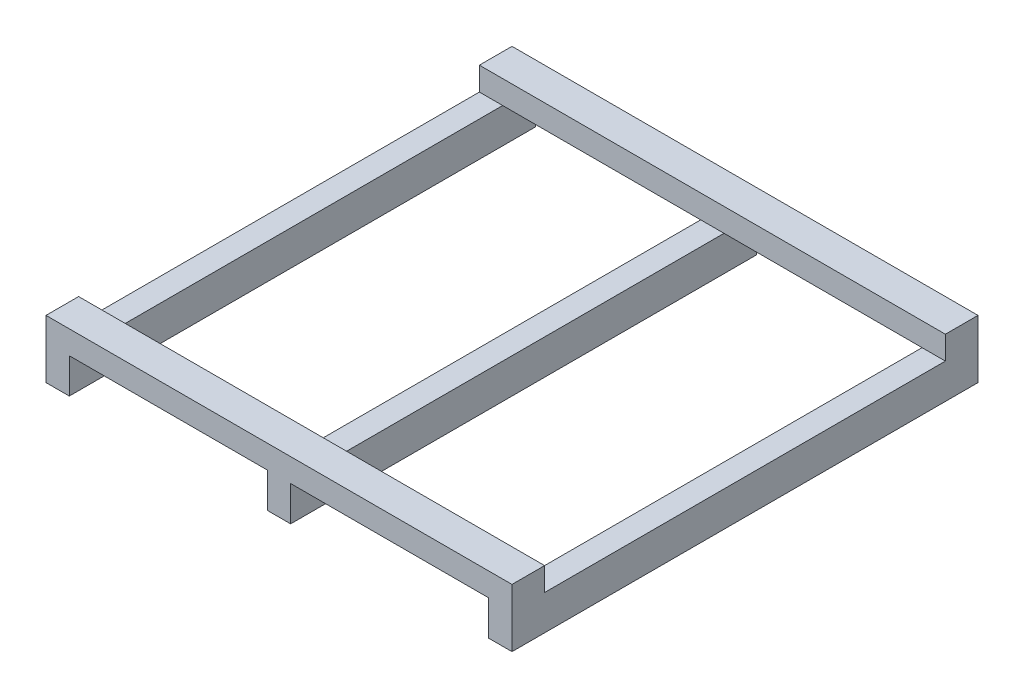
ISO-10303-21;
HEADER;
FILE_DESCRIPTION(('STEP AP214'),'2;1');
FILE_NAME('part.step','',(''),(''),'','','');
FILE_SCHEMA(('AUTOMOTIVE_DESIGN { 1 0 10303 214 1 1 1 1 }'));
ENDSEC;
DATA;
#1=APPLICATION_CONTEXT('core data for automotive mechanical design processes');
#2=APPLICATION_PROTOCOL_DEFINITION('international standard','automotive_design',2000,#1);
#3=PRODUCT_CONTEXT('',#1,'mechanical');
#4=PRODUCT('Part','Part','',(#3));
#5=PRODUCT_RELATED_PRODUCT_CATEGORY('part','',(#4));
#6=PRODUCT_DEFINITION_FORMATION('','',#4);
#7=PRODUCT_DEFINITION_CONTEXT('part definition',#1,'design');
#8=PRODUCT_DEFINITION('design','',#6,#7);
#9=PRODUCT_DEFINITION_SHAPE('','',#8);
#10=(LENGTH_UNIT() NAMED_UNIT(*) SI_UNIT(.MILLI.,.METRE.));
#11=(NAMED_UNIT(*) PLANE_ANGLE_UNIT() SI_UNIT($,.RADIAN.));
#12=(NAMED_UNIT(*) SI_UNIT($,.STERADIAN.) SOLID_ANGLE_UNIT());
#13=UNCERTAINTY_MEASURE_WITH_UNIT(LENGTH_MEASURE(1.E-05),#10,'distance_accuracy_value','');
#14=(GEOMETRIC_REPRESENTATION_CONTEXT(3) GLOBAL_UNCERTAINTY_ASSIGNED_CONTEXT((#13)) GLOBAL_UNIT_ASSIGNED_CONTEXT((#10,
#11,#12)) REPRESENTATION_CONTEXT('',''));
#15=CARTESIAN_POINT('',(0.,0.,0.));
#16=DIRECTION('',(0.,0.,1.));
#17=DIRECTION('',(1.,0.,0.));
#18=AXIS2_PLACEMENT_3D('',#15,#16,#17);
#19=CARTESIAN_POINT('',(586.023252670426,75.,-500.));
#20=DIRECTION('',(0.,-1.,0.));
#21=DIRECTION('',(0.,0.,-1.));
#22=AXIS2_PLACEMENT_3D('',#19,#20,#21);
#23=PLANE('',#22);
#24=DIRECTION('',(0.,0.,1.));
#25=VECTOR('',#24,1.);
#26=CARTESIAN_POINT('',(-25.,75.,-500.));
#27=LINE('',#26,#25);
#28=CARTESIAN_POINT('',(-25.,75.,-500.));
#29=VERTEX_POINT('',#28);
#30=CARTESIAN_POINT('',(-25.,75.,-430.));
#31=VERTEX_POINT('',#30);
#32=EDGE_CURVE('E261',#29,#31,#27,.T.);
#33=ORIENTED_EDGE('',*,*,#32,.T.);
#34=DIRECTION('',(-1.,0.,0.));
#35=VECTOR('',#34,1.);
#36=CARTESIAN_POINT('',(586.023252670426,75.,-430.));
#37=LINE('',#36,#35);
#38=CARTESIAN_POINT('',(-450.,75.,-430.));
#39=VERTEX_POINT('',#38);
#40=EDGE_CURVE('E275',#31,#39,#37,.T.);
#41=ORIENTED_EDGE('',*,*,#40,.T.);
#42=DIRECTION('',(0.,0.,1.));
#43=VECTOR('',#42,1.);
#44=CARTESIAN_POINT('',(-450.,75.,-500.));
#45=LINE('',#44,#43);
#46=CARTESIAN_POINT('',(-450.,75.,-500.));
#47=VERTEX_POINT('',#46);
#48=EDGE_CURVE('E305',#47,#39,#45,.T.);
#49=ORIENTED_EDGE('',*,*,#48,.F.);
#50=DIRECTION('',(-1.,0.,0.));
#51=VECTOR('',#50,1.);
#52=CARTESIAN_POINT('',(586.023252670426,75.,-500.));
#53=LINE('',#52,#51);
#54=EDGE_CURVE('E56',#29,#47,#53,.T.);
#55=ORIENTED_EDGE('',*,*,#54,.F.);
#56=EDGE_LOOP('',(#33,#41,#49,#55));
#57=FACE_BOUND('',#56,.T.);
#58=ADVANCED_FACE('F31',(#57),#23,.T.);
#59=CARTESIAN_POINT('',(-450.,75.,-500.));
#60=DIRECTION('',(0.,1.,0.));
#61=DIRECTION('',(-1.,0.,0.));
#62=AXIS2_PLACEMENT_3D('',#59,#60,#61);
#63=PLANE('',#62);
#64=DIRECTION('',(-1.,0.,0.));
#65=VECTOR('',#64,1.);
#66=CARTESIAN_POINT('',(586.023252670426,75.,430.));
#67=LINE('',#66,#65);
#68=CARTESIAN_POINT('',(-450.,75.,430.));
#69=VERTEX_POINT('',#68);
#70=CARTESIAN_POINT('',(-500.,75.,430.));
#71=VERTEX_POINT('',#70);
#72=EDGE_CURVE('E184',#69,#71,#67,.T.);
#73=ORIENTED_EDGE('',*,*,#72,.F.);
#74=EDGE_CURVE('E308',#39,#69,#45,.T.);
#75=ORIENTED_EDGE('',*,*,#74,.F.);
#76=CARTESIAN_POINT('',(-500.,75.,-430.));
#77=VERTEX_POINT('',#76);
#78=EDGE_CURVE('E11',#39,#77,#37,.T.);
#79=ORIENTED_EDGE('',*,*,#78,.T.);
#80=DIRECTION('',(0.,0.,1.));
#81=VECTOR('',#80,1.);
#82=CARTESIAN_POINT('',(-500.,75.,-500.));
#83=LINE('',#82,#81);
#84=EDGE_CURVE('E298',#77,#71,#83,.T.);
#85=ORIENTED_EDGE('',*,*,#84,.T.);
#86=EDGE_LOOP('',(#73,#75,#79,#85));
#87=FACE_BOUND('',#86,.T.);
#88=ADVANCED_FACE('F412',(#87),#63,.T.);
#89=CARTESIAN_POINT('',(-450.,0.,-500.));
#90=DIRECTION('',(1.,0.,0.));
#91=DIRECTION('',(0.,1.,0.));
#92=AXIS2_PLACEMENT_3D('',#89,#90,#91);
#93=PLANE('',#92);
#94=ORIENTED_EDGE('',*,*,#48,.T.);
#95=ORIENTED_EDGE('',*,*,#74,.T.);
#96=DIRECTION('',(0.,0.,-1.));
#97=VECTOR('',#96,1.);
#98=CARTESIAN_POINT('',(-450.,74.9999999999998,-500.));
#99=LINE('',#98,#97);
#100=CARTESIAN_POINT('',(-450.,75.,500.));
#101=VERTEX_POINT('',#100);
#102=EDGE_CURVE('E218',#101,#69,#99,.T.);
#103=ORIENTED_EDGE('',*,*,#102,.F.);
#104=DIRECTION('',(0.,1.,0.));
#105=VECTOR('',#104,1.);
#106=CARTESIAN_POINT('',(-450.,0.,500.));
#107=LINE('',#106,#105);
#108=CARTESIAN_POINT('',(-450.,0.,500.));
#109=VERTEX_POINT('',#108);
#110=EDGE_CURVE('E329',#109,#101,#107,.T.);
#111=ORIENTED_EDGE('',*,*,#110,.F.);
#112=DIRECTION('',(0.,0.,1.));
#113=VECTOR('',#112,1.);
#114=CARTESIAN_POINT('',(-450.,0.,-500.));
#115=LINE('',#114,#113);
#116=CARTESIAN_POINT('',(-450.,0.,-500.));
#117=VERTEX_POINT('',#116);
#118=EDGE_CURVE('E41',#117,#109,#115,.T.);
#119=ORIENTED_EDGE('',*,*,#118,.F.);
#120=DIRECTION('',(0.,1.,0.));
#121=VECTOR('',#120,1.);
#122=CARTESIAN_POINT('',(-450.,0.,-500.));
#123=LINE('',#122,#121);
#124=EDGE_CURVE('E309',#117,#47,#123,.T.);
#125=ORIENTED_EDGE('',*,*,#124,.T.);
#126=EDGE_LOOP('',(#94,#95,#103,#111,#119,#125));
#127=FACE_BOUND('',#126,.T.);
#128=ADVANCED_FACE('F33',(#127),#93,.T.);
#129=CARTESIAN_POINT('',(-450.,0.,-500.));
#130=DIRECTION('',(0.,-1.,0.));
#131=DIRECTION('',(1.,0.,0.));
#132=AXIS2_PLACEMENT_3D('',#129,#130,#131);
#133=PLANE('',#132);
#134=ORIENTED_EDGE('',*,*,#118,.T.);
#135=DIRECTION('',(1.,0.,0.));
#136=VECTOR('',#135,1.);
#137=CARTESIAN_POINT('',(-450.,0.,500.));
#138=LINE('',#137,#136);
#139=CARTESIAN_POINT('',(-500.,0.,500.));
#140=VERTEX_POINT('',#139);
#141=EDGE_CURVE('E324',#140,#109,#138,.T.);
#142=ORIENTED_EDGE('',*,*,#141,.F.);
#143=DIRECTION('',(0.,0.,1.));
#144=VECTOR('',#143,1.);
#145=CARTESIAN_POINT('',(-500.,0.,-500.));
#146=LINE('',#145,#144);
#147=CARTESIAN_POINT('',(-500.,0.,-500.));
#148=VERTEX_POINT('',#147);
#149=EDGE_CURVE('E316',#148,#140,#146,.T.);
#150=ORIENTED_EDGE('',*,*,#149,.F.);
#151=DIRECTION('',(1.,0.,0.));
#152=VECTOR('',#151,1.);
#153=CARTESIAN_POINT('',(-450.,0.,-500.));
#154=LINE('',#153,#152);
#155=EDGE_CURVE('E313',#148,#117,#154,.T.);
#156=ORIENTED_EDGE('',*,*,#155,.T.);
#157=EDGE_LOOP('',(#134,#142,#150,#156));
#158=FACE_BOUND('',#157,.T.);
#159=ADVANCED_FACE('F348',(#158),#133,.T.);
#160=CARTESIAN_POINT('',(-500.,0.,-500.));
#161=DIRECTION('',(-1.,0.,0.));
#162=DIRECTION('',(0.,0.,1.));
#163=AXIS2_PLACEMENT_3D('',#160,#161,#162);
#164=PLANE('',#163);
#165=ORIENTED_EDGE('',*,*,#149,.T.);
#166=DIRECTION('',(0.,-1.,0.));
#167=VECTOR('',#166,1.);
#168=CARTESIAN_POINT('',(-500.,0.,500.));
#169=LINE('',#168,#167);
#170=CARTESIAN_POINT('',(-500.,125.,500.));
#171=VERTEX_POINT('',#170);
#172=EDGE_CURVE('E327',#171,#140,#169,.T.);
#173=ORIENTED_EDGE('',*,*,#172,.F.);
#174=DIRECTION('',(0.,0.,-1.));
#175=VECTOR('',#174,1.);
#176=CARTESIAN_POINT('',(-500.,125.,500.));
#177=LINE('',#176,#175);
#178=CARTESIAN_POINT('',(-500.,125.,430.));
#179=VERTEX_POINT('',#178);
#180=EDGE_CURVE('E199',#171,#179,#177,.T.);
#181=ORIENTED_EDGE('',*,*,#180,.T.);
#182=DIRECTION('',(0.,-1.,0.));
#183=VECTOR('',#182,1.);
#184=CARTESIAN_POINT('',(-500.,75.,430.));
#185=LINE('',#184,#183);
#186=EDGE_CURVE('E190',#179,#71,#185,.T.);
#187=ORIENTED_EDGE('',*,*,#186,.T.);
#188=ORIENTED_EDGE('',*,*,#84,.F.);
#189=DIRECTION('',(0.,1.,0.));
#190=VECTOR('',#189,1.);
#191=CARTESIAN_POINT('',(-500.,75.,-430.));
#192=LINE('',#191,#190);
#193=CARTESIAN_POINT('',(-500.,125.,-430.));
#194=VERTEX_POINT('',#193);
#195=EDGE_CURVE('E263',#77,#194,#192,.T.);
#196=ORIENTED_EDGE('',*,*,#195,.T.);
#197=DIRECTION('',(0.,0.,-1.));
#198=VECTOR('',#197,1.);
#199=CARTESIAN_POINT('',(-500.,125.,-500.));
#200=LINE('',#199,#198);
#201=CARTESIAN_POINT('',(-500.,125.,-500.));
#202=VERTEX_POINT('',#201);
#203=EDGE_CURVE('E272',#194,#202,#200,.T.);
#204=ORIENTED_EDGE('',*,*,#203,.T.);
#205=DIRECTION('',(0.,-1.,0.));
#206=VECTOR('',#205,1.);
#207=CARTESIAN_POINT('',(-500.,0.,-500.));
#208=LINE('',#207,#206);
#209=EDGE_CURVE('E321',#202,#148,#208,.T.);
#210=ORIENTED_EDGE('',*,*,#209,.T.);
#211=EDGE_LOOP('',(#165,#173,#181,#187,#188,#196,#204,#210));
#212=FACE_BOUND('',#211,.T.);
#213=ADVANCED_FACE('F351',(#212),#164,.T.);
#214=CARTESIAN_POINT('',(-450.,75.,-500.));
#215=DIRECTION('',(0.,0.,1.));
#216=DIRECTION('',(1.,0.,0.));
#217=AXIS2_PLACEMENT_3D('',#214,#215,#216);
#218=PLANE('',#217);
#219=ORIENTED_EDGE('',*,*,#124,.F.);
#220=ORIENTED_EDGE('',*,*,#155,.F.);
#221=ORIENTED_EDGE('',*,*,#209,.F.);
#222=DIRECTION('',(-1.,0.,0.));
#223=VECTOR('',#222,1.);
#224=CARTESIAN_POINT('',(586.023252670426,125.,-500.));
#225=LINE('',#224,#223);
#226=CARTESIAN_POINT('',(500.,125.,-500.));
#227=VERTEX_POINT('',#226);
#228=EDGE_CURVE('E278',#227,#202,#225,.T.);
#229=ORIENTED_EDGE('',*,*,#228,.F.);
#230=DIRECTION('',(0.,-1.,0.));
#231=VECTOR('',#230,1.);
#232=CARTESIAN_POINT('',(500.,75.,-500.));
#233=LINE('',#232,#231);
#234=CARTESIAN_POINT('',(500.,0.,-500.));
#235=VERTEX_POINT('',#234);
#236=EDGE_CURVE('E276',#227,#235,#233,.T.);
#237=ORIENTED_EDGE('',*,*,#236,.T.);
#238=DIRECTION('',(1.,0.,0.));
#239=VECTOR('',#238,1.);
#240=CARTESIAN_POINT('',(450.,0.,-500.));
#241=LINE('',#240,#239);
#242=CARTESIAN_POINT('',(450.,0.,-500.));
#243=VERTEX_POINT('',#242);
#244=EDGE_CURVE('E231',#243,#235,#241,.T.);
#245=ORIENTED_EDGE('',*,*,#244,.F.);
#246=DIRECTION('',(0.,-1.,0.));
#247=VECTOR('',#246,1.);
#248=CARTESIAN_POINT('',(450.,0.,-500.));
#249=LINE('',#248,#247);
#250=CARTESIAN_POINT('',(450.,75.,-500.));
#251=VERTEX_POINT('',#250);
#252=EDGE_CURVE('E228',#251,#243,#249,.T.);
#253=ORIENTED_EDGE('',*,*,#252,.F.);
#254=CARTESIAN_POINT('',(25.,75.,-500.));
#255=VERTEX_POINT('',#254);
#256=EDGE_CURVE('E35',#251,#255,#53,.T.);
#257=ORIENTED_EDGE('',*,*,#256,.T.);
#258=DIRECTION('',(0.,1.,0.));
#259=VECTOR('',#258,1.);
#260=CARTESIAN_POINT('',(25.,0.,-500.));
#261=LINE('',#260,#259);
#262=CARTESIAN_POINT('',(25.,0.,-500.));
#263=VERTEX_POINT('',#262);
#264=EDGE_CURVE('E257',#263,#255,#261,.T.);
#265=ORIENTED_EDGE('',*,*,#264,.F.);
#266=DIRECTION('',(1.,0.,0.));
#267=VECTOR('',#266,1.);
#268=CARTESIAN_POINT('',(-25.,0.,-500.));
#269=LINE('',#268,#267);
#270=CARTESIAN_POINT('',(-25.,0.,-500.));
#271=VERTEX_POINT('',#270);
#272=EDGE_CURVE('E254',#271,#263,#269,.T.);
#273=ORIENTED_EDGE('',*,*,#272,.F.);
#274=DIRECTION('',(0.,-1.,0.));
#275=VECTOR('',#274,1.);
#276=CARTESIAN_POINT('',(-25.,0.,-500.));
#277=LINE('',#276,#275);
#278=EDGE_CURVE('E251',#29,#271,#277,.T.);
#279=ORIENTED_EDGE('',*,*,#278,.F.);
#280=ORIENTED_EDGE('',*,*,#54,.T.);
#281=EDGE_LOOP('',(#219,#220,#221,#229,#237,#245,#253,#257,#265,#273,#279,#280));
#282=FACE_BOUND('',#281,.T.);
#283=ADVANCED_FACE('F339',(#282),#218,.F.);
#284=CARTESIAN_POINT('',(-450.,75.,500.));
#285=DIRECTION('',(0.,0.,1.));
#286=DIRECTION('',(1.,0.,0.));
#287=AXIS2_PLACEMENT_3D('',#284,#285,#286);
#288=PLANE('',#287);
#289=ORIENTED_EDGE('',*,*,#110,.T.);
#290=DIRECTION('',(-1.,0.,0.));
#291=VECTOR('',#290,1.);
#292=CARTESIAN_POINT('',(586.023252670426,75.,500.));
#293=LINE('',#292,#291);
#294=CARTESIAN_POINT('',(-25.,75.,500.));
#295=VERTEX_POINT('',#294);
#296=EDGE_CURVE('E203',#295,#101,#293,.T.);
#297=ORIENTED_EDGE('',*,*,#296,.F.);
#298=DIRECTION('',(0.,-1.,0.));
#299=VECTOR('',#298,1.);
#300=CARTESIAN_POINT('',(-25.,0.,500.));
#301=LINE('',#300,#299);
#302=CARTESIAN_POINT('',(-25.,0.,500.));
#303=VERTEX_POINT('',#302);
#304=EDGE_CURVE('E237',#295,#303,#301,.T.);
#305=ORIENTED_EDGE('',*,*,#304,.T.);
#306=DIRECTION('',(1.,0.,0.));
#307=VECTOR('',#306,1.);
#308=CARTESIAN_POINT('',(-25.,0.,500.));
#309=LINE('',#308,#307);
#310=CARTESIAN_POINT('',(25.,0.,500.));
#311=VERTEX_POINT('',#310);
#312=EDGE_CURVE('E245',#303,#311,#309,.T.);
#313=ORIENTED_EDGE('',*,*,#312,.T.);
#314=DIRECTION('',(0.,1.,0.));
#315=VECTOR('',#314,1.);
#316=CARTESIAN_POINT('',(25.,0.,500.));
#317=LINE('',#316,#315);
#318=CARTESIAN_POINT('',(25.,75.,500.));
#319=VERTEX_POINT('',#318);
#320=EDGE_CURVE('E248',#311,#319,#317,.T.);
#321=ORIENTED_EDGE('',*,*,#320,.T.);
#322=CARTESIAN_POINT('',(450.,75.,500.));
#323=VERTEX_POINT('',#322);
#324=EDGE_CURVE('E205',#323,#319,#293,.T.);
#325=ORIENTED_EDGE('',*,*,#324,.F.);
#326=DIRECTION('',(0.,-1.,0.));
#327=VECTOR('',#326,1.);
#328=CARTESIAN_POINT('',(450.,0.,500.));
#329=LINE('',#328,#327);
#330=CARTESIAN_POINT('',(450.,0.,500.));
#331=VERTEX_POINT('',#330);
#332=EDGE_CURVE('E220',#323,#331,#329,.T.);
#333=ORIENTED_EDGE('',*,*,#332,.T.);
#334=DIRECTION('',(1.,0.,0.));
#335=VECTOR('',#334,1.);
#336=CARTESIAN_POINT('',(450.,0.,500.));
#337=LINE('',#336,#335);
#338=CARTESIAN_POINT('',(500.,0.,500.));
#339=VERTEX_POINT('',#338);
#340=EDGE_CURVE('E223',#331,#339,#337,.T.);
#341=ORIENTED_EDGE('',*,*,#340,.T.);
#342=DIRECTION('',(0.,1.,0.));
#343=VECTOR('',#342,1.);
#344=CARTESIAN_POINT('',(500.,0.,500.));
#345=LINE('',#344,#343);
#346=CARTESIAN_POINT('',(500.,125.,500.));
#347=VERTEX_POINT('',#346);
#348=EDGE_CURVE('E226',#339,#347,#345,.T.);
#349=ORIENTED_EDGE('',*,*,#348,.T.);
#350=DIRECTION('',(-1.,0.,0.));
#351=VECTOR('',#350,1.);
#352=CARTESIAN_POINT('',(586.023252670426,125.,500.));
#353=LINE('',#352,#351);
#354=EDGE_CURVE('E197',#347,#171,#353,.T.);
#355=ORIENTED_EDGE('',*,*,#354,.T.);
#356=ORIENTED_EDGE('',*,*,#172,.T.);
#357=ORIENTED_EDGE('',*,*,#141,.T.);
#358=EDGE_LOOP('',(#289,#297,#305,#313,#321,#325,#333,#341,#349,#355,#356,#357));
#359=FACE_BOUND('',#358,.T.);
#360=ADVANCED_FACE('F349',(#359),#288,.T.);
#361=DIRECTION('',(0.,0.,1.));
#362=VECTOR('',#361,1.);
#363=CARTESIAN_POINT('',(450.,75.,-500.));
#364=LINE('',#363,#362);
#365=CARTESIAN_POINT('',(450.,75.,-430.));
#366=VERTEX_POINT('',#365);
#367=EDGE_CURVE('E235',#251,#366,#364,.T.);
#368=ORIENTED_EDGE('',*,*,#367,.T.);
#369=CARTESIAN_POINT('',(25.,75.,-430.));
#370=VERTEX_POINT('',#369);
#371=EDGE_CURVE('E292',#366,#370,#37,.T.);
#372=ORIENTED_EDGE('',*,*,#371,.T.);
#373=DIRECTION('',(0.,0.,1.));
#374=VECTOR('',#373,1.);
#375=CARTESIAN_POINT('',(25.,75.,-500.));
#376=LINE('',#375,#374);
#377=EDGE_CURVE('E265',#255,#370,#376,.T.);
#378=ORIENTED_EDGE('',*,*,#377,.F.);
#379=ORIENTED_EDGE('',*,*,#256,.F.);
#380=EDGE_LOOP('',(#368,#372,#378,#379));
#381=FACE_BOUND('',#380,.T.);
#382=ADVANCED_FACE('F368',(#381),#23,.T.);
#383=CARTESIAN_POINT('',(500.,0.,-500.));
#384=DIRECTION('',(1.,0.,0.));
#385=DIRECTION('',(0.,0.,-1.));
#386=AXIS2_PLACEMENT_3D('',#383,#384,#385);
#387=PLANE('',#386);
#388=ORIENTED_EDGE('',*,*,#236,.F.);
#389=DIRECTION('',(0.,0.,-1.));
#390=VECTOR('',#389,1.);
#391=CARTESIAN_POINT('',(500.,125.,-500.));
#392=LINE('',#391,#390);
#393=CARTESIAN_POINT('',(500.,125.,-430.));
#394=VERTEX_POINT('',#393);
#395=EDGE_CURVE('E279',#394,#227,#392,.T.);
#396=ORIENTED_EDGE('',*,*,#395,.F.);
#397=DIRECTION('',(0.,1.,0.));
#398=VECTOR('',#397,1.);
#399=CARTESIAN_POINT('',(500.,75.,-430.));
#400=LINE('',#399,#398);
#401=CARTESIAN_POINT('',(500.,75.,-430.));
#402=VERTEX_POINT('',#401);
#403=EDGE_CURVE('E283',#402,#394,#400,.T.);
#404=ORIENTED_EDGE('',*,*,#403,.F.);
#405=DIRECTION('',(0.,0.,1.));
#406=VECTOR('',#405,1.);
#407=CARTESIAN_POINT('',(500.,75.,-500.));
#408=LINE('',#407,#406);
#409=CARTESIAN_POINT('',(500.,75.,430.));
#410=VERTEX_POINT('',#409);
#411=EDGE_CURVE('E180',#402,#410,#408,.T.);
#412=ORIENTED_EDGE('',*,*,#411,.T.);
#413=DIRECTION('',(0.,-1.,0.));
#414=VECTOR('',#413,1.);
#415=CARTESIAN_POINT('',(500.,75.,430.));
#416=LINE('',#415,#414);
#417=CARTESIAN_POINT('',(500.,125.,430.));
#418=VERTEX_POINT('',#417);
#419=EDGE_CURVE('E172',#418,#410,#416,.T.);
#420=ORIENTED_EDGE('',*,*,#419,.F.);
#421=DIRECTION('',(0.,0.,-1.));
#422=VECTOR('',#421,1.);
#423=CARTESIAN_POINT('',(500.,125.,500.));
#424=LINE('',#423,#422);
#425=EDGE_CURVE('E177',#347,#418,#424,.T.);
#426=ORIENTED_EDGE('',*,*,#425,.F.);
#427=ORIENTED_EDGE('',*,*,#348,.F.);
#428=DIRECTION('',(0.,0.,1.));
#429=VECTOR('',#428,1.);
#430=CARTESIAN_POINT('',(500.,0.,-500.));
#431=LINE('',#430,#429);
#432=EDGE_CURVE('E240',#235,#339,#431,.T.);
#433=ORIENTED_EDGE('',*,*,#432,.F.);
#434=EDGE_LOOP('',(#388,#396,#404,#412,#420,#426,#427,#433));
#435=FACE_BOUND('',#434,.T.);
#436=ADVANCED_FACE('F174',(#435),#387,.T.);
#437=CARTESIAN_POINT('',(586.023252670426,75.,-430.));
#438=DIRECTION('',(0.,0.,1.));
#439=DIRECTION('',(1.,0.,0.));
#440=AXIS2_PLACEMENT_3D('',#437,#438,#439);
#441=PLANE('',#440);
#442=EDGE_CURVE('E286',#402,#366,#37,.T.);
#443=ORIENTED_EDGE('',*,*,#442,.F.);
#444=ORIENTED_EDGE('',*,*,#403,.T.);
#445=DIRECTION('',(-1.,0.,0.));
#446=VECTOR('',#445,1.);
#447=CARTESIAN_POINT('',(586.023252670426,125.,-430.));
#448=LINE('',#447,#446);
#449=EDGE_CURVE('E282',#394,#194,#448,.T.);
#450=ORIENTED_EDGE('',*,*,#449,.T.);
#451=ORIENTED_EDGE('',*,*,#195,.F.);
#452=ORIENTED_EDGE('',*,*,#78,.F.);
#453=ORIENTED_EDGE('',*,*,#40,.F.);
#454=EDGE_CURVE('E293',#370,#31,#37,.T.);
#455=ORIENTED_EDGE('',*,*,#454,.F.);
#456=ORIENTED_EDGE('',*,*,#371,.F.);
#457=EDGE_LOOP('',(#443,#444,#450,#451,#452,#453,#455,#456));
#458=FACE_BOUND('',#457,.T.);
#459=ADVANCED_FACE('F373',(#458),#441,.T.);
#460=CARTESIAN_POINT('',(586.023252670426,125.,-500.));
#461=DIRECTION('',(0.,1.,0.));
#462=DIRECTION('',(0.,0.,1.));
#463=AXIS2_PLACEMENT_3D('',#460,#461,#462);
#464=PLANE('',#463);
#465=ORIENTED_EDGE('',*,*,#449,.F.);
#466=ORIENTED_EDGE('',*,*,#395,.T.);
#467=ORIENTED_EDGE('',*,*,#228,.T.);
#468=ORIENTED_EDGE('',*,*,#203,.F.);
#469=EDGE_LOOP('',(#465,#466,#467,#468));
#470=FACE_BOUND('',#469,.T.);
#471=ADVANCED_FACE('F356',(#470),#464,.T.);
#472=CARTESIAN_POINT('',(-25.,0.,-500.));
#473=DIRECTION('',(-1.,0.,0.));
#474=DIRECTION('',(0.,0.,1.));
#475=AXIS2_PLACEMENT_3D('',#472,#473,#474);
#476=PLANE('',#475);
#477=DIRECTION('',(0.,0.,1.));
#478=VECTOR('',#477,1.);
#479=CARTESIAN_POINT('',(-25.,0.,-500.));
#480=LINE('',#479,#478);
#481=EDGE_CURVE('E260',#271,#303,#480,.T.);
#482=ORIENTED_EDGE('',*,*,#481,.T.);
#483=ORIENTED_EDGE('',*,*,#304,.F.);
#484=DIRECTION('',(0.,0.,1.));
#485=VECTOR('',#484,1.);
#486=CARTESIAN_POINT('',(-25.,74.9999999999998,-500.));
#487=LINE('',#486,#485);
#488=CARTESIAN_POINT('',(-25.,75.,430.));
#489=VERTEX_POINT('',#488);
#490=EDGE_CURVE('E215',#489,#295,#487,.T.);
#491=ORIENTED_EDGE('',*,*,#490,.F.);
#492=EDGE_CURVE('E264',#31,#489,#27,.T.);
#493=ORIENTED_EDGE('',*,*,#492,.F.);
#494=ORIENTED_EDGE('',*,*,#32,.F.);
#495=ORIENTED_EDGE('',*,*,#278,.T.);
#496=EDGE_LOOP('',(#482,#483,#491,#493,#494,#495));
#497=FACE_BOUND('',#496,.T.);
#498=ADVANCED_FACE('F384',(#497),#476,.T.);
#499=CARTESIAN_POINT('',(-25.,75.,-500.));
#500=DIRECTION('',(0.,1.,0.));
#501=DIRECTION('',(0.,0.,1.));
#502=AXIS2_PLACEMENT_3D('',#499,#500,#501);
#503=PLANE('',#502);
#504=CARTESIAN_POINT('',(25.,75.,430.));
#505=VERTEX_POINT('',#504);
#506=EDGE_CURVE('E392',#505,#489,#67,.T.);
#507=ORIENTED_EDGE('',*,*,#506,.F.);
#508=EDGE_CURVE('E268',#370,#505,#376,.T.);
#509=ORIENTED_EDGE('',*,*,#508,.F.);
#510=ORIENTED_EDGE('',*,*,#454,.T.);
#511=ORIENTED_EDGE('',*,*,#492,.T.);
#512=EDGE_LOOP('',(#507,#509,#510,#511));
#513=FACE_BOUND('',#512,.T.);
#514=ADVANCED_FACE('F380',(#513),#503,.T.);
#515=CARTESIAN_POINT('',(25.,0.,-500.));
#516=DIRECTION('',(1.,0.,0.));
#517=DIRECTION('',(0.,0.,-1.));
#518=AXIS2_PLACEMENT_3D('',#515,#516,#517);
#519=PLANE('',#518);
#520=ORIENTED_EDGE('',*,*,#377,.T.);
#521=ORIENTED_EDGE('',*,*,#508,.T.);
#522=DIRECTION('',(0.,0.,-1.));
#523=VECTOR('',#522,1.);
#524=CARTESIAN_POINT('',(25.,74.9999999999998,-500.));
#525=LINE('',#524,#523);
#526=EDGE_CURVE('E213',#319,#505,#525,.T.);
#527=ORIENTED_EDGE('',*,*,#526,.F.);
#528=ORIENTED_EDGE('',*,*,#320,.F.);
#529=DIRECTION('',(0.,0.,1.));
#530=VECTOR('',#529,1.);
#531=CARTESIAN_POINT('',(25.,0.,-500.));
#532=LINE('',#531,#530);
#533=EDGE_CURVE('E269',#263,#311,#532,.T.);
#534=ORIENTED_EDGE('',*,*,#533,.F.);
#535=ORIENTED_EDGE('',*,*,#264,.T.);
#536=EDGE_LOOP('',(#520,#521,#527,#528,#534,#535));
#537=FACE_BOUND('',#536,.T.);
#538=ADVANCED_FACE('F396',(#537),#519,.T.);
#539=CARTESIAN_POINT('',(-25.,0.,-500.));
#540=DIRECTION('',(0.,-1.,0.));
#541=DIRECTION('',(0.,0.,-1.));
#542=AXIS2_PLACEMENT_3D('',#539,#540,#541);
#543=PLANE('',#542);
#544=ORIENTED_EDGE('',*,*,#533,.T.);
#545=ORIENTED_EDGE('',*,*,#312,.F.);
#546=ORIENTED_EDGE('',*,*,#481,.F.);
#547=ORIENTED_EDGE('',*,*,#272,.T.);
#548=EDGE_LOOP('',(#544,#545,#546,#547));
#549=FACE_BOUND('',#548,.T.);
#550=ADVANCED_FACE('F399',(#549),#543,.T.);
#551=CARTESIAN_POINT('',(450.,0.,-500.));
#552=DIRECTION('',(-1.,0.,0.));
#553=DIRECTION('',(0.,0.,1.));
#554=AXIS2_PLACEMENT_3D('',#551,#552,#553);
#555=PLANE('',#554);
#556=DIRECTION('',(0.,0.,1.));
#557=VECTOR('',#556,1.);
#558=CARTESIAN_POINT('',(450.,0.,-500.));
#559=LINE('',#558,#557);
#560=EDGE_CURVE('E234',#243,#331,#559,.T.);
#561=ORIENTED_EDGE('',*,*,#560,.T.);
#562=ORIENTED_EDGE('',*,*,#332,.F.);
#563=DIRECTION('',(0.,0.,1.));
#564=VECTOR('',#563,1.);
#565=CARTESIAN_POINT('',(450.,74.9999999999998,-500.));
#566=LINE('',#565,#564);
#567=CARTESIAN_POINT('',(450.,75.,430.));
#568=VERTEX_POINT('',#567);
#569=EDGE_CURVE('E210',#568,#323,#566,.T.);
#570=ORIENTED_EDGE('',*,*,#569,.F.);
#571=EDGE_CURVE('E238',#366,#568,#364,.T.);
#572=ORIENTED_EDGE('',*,*,#571,.F.);
#573=ORIENTED_EDGE('',*,*,#367,.F.);
#574=ORIENTED_EDGE('',*,*,#252,.T.);
#575=EDGE_LOOP('',(#561,#562,#570,#572,#573,#574));
#576=FACE_BOUND('',#575,.T.);
#577=ADVANCED_FACE('F362',(#576),#555,.T.);
#578=CARTESIAN_POINT('',(450.,75.,-500.));
#579=DIRECTION('',(0.,1.,0.));
#580=DIRECTION('',(-1.,0.,0.));
#581=AXIS2_PLACEMENT_3D('',#578,#579,#580);
#582=PLANE('',#581);
#583=EDGE_CURVE('E206',#410,#568,#67,.T.);
#584=ORIENTED_EDGE('',*,*,#583,.F.);
#585=ORIENTED_EDGE('',*,*,#411,.F.);
#586=ORIENTED_EDGE('',*,*,#442,.T.);
#587=ORIENTED_EDGE('',*,*,#571,.T.);
#588=EDGE_LOOP('',(#584,#585,#586,#587));
#589=FACE_BOUND('',#588,.T.);
#590=ADVANCED_FACE('F371',(#589),#582,.T.);
#591=CARTESIAN_POINT('',(450.,0.,-500.));
#592=DIRECTION('',(0.,-1.,0.));
#593=DIRECTION('',(0.,0.,-1.));
#594=AXIS2_PLACEMENT_3D('',#591,#592,#593);
#595=PLANE('',#594);
#596=ORIENTED_EDGE('',*,*,#432,.T.);
#597=ORIENTED_EDGE('',*,*,#340,.F.);
#598=ORIENTED_EDGE('',*,*,#560,.F.);
#599=ORIENTED_EDGE('',*,*,#244,.T.);
#600=EDGE_LOOP('',(#596,#597,#598,#599));
#601=FACE_BOUND('',#600,.T.);
#602=ADVANCED_FACE('F410',(#601),#595,.T.);
#603=CARTESIAN_POINT('',(586.023252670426,75.,500.));
#604=DIRECTION('',(0.,-1.,0.));
#605=DIRECTION('',(0.,0.,-1.));
#606=AXIS2_PLACEMENT_3D('',#603,#604,#605);
#607=PLANE('',#606);
#608=ORIENTED_EDGE('',*,*,#296,.T.);
#609=ORIENTED_EDGE('',*,*,#102,.T.);
#610=EDGE_CURVE('E389',#489,#69,#67,.T.);
#611=ORIENTED_EDGE('',*,*,#610,.F.);
#612=ORIENTED_EDGE('',*,*,#490,.T.);
#613=EDGE_LOOP('',(#608,#609,#611,#612));
#614=FACE_BOUND('',#613,.T.);
#615=ADVANCED_FACE('F387',(#614),#607,.T.);
#616=CARTESIAN_POINT('',(586.023252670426,125.,500.));
#617=DIRECTION('',(0.,1.,0.));
#618=DIRECTION('',(0.,0.,1.));
#619=AXIS2_PLACEMENT_3D('',#616,#617,#618);
#620=PLANE('',#619);
#621=ORIENTED_EDGE('',*,*,#354,.F.);
#622=ORIENTED_EDGE('',*,*,#425,.T.);
#623=DIRECTION('',(-1.,0.,0.));
#624=VECTOR('',#623,1.);
#625=CARTESIAN_POINT('',(586.023252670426,125.,430.));
#626=LINE('',#625,#624);
#627=EDGE_CURVE('E185',#418,#179,#626,.T.);
#628=ORIENTED_EDGE('',*,*,#627,.T.);
#629=ORIENTED_EDGE('',*,*,#180,.F.);
#630=EDGE_LOOP('',(#621,#622,#628,#629));
#631=FACE_BOUND('',#630,.T.);
#632=ADVANCED_FACE('F195',(#631),#620,.T.);
#633=CARTESIAN_POINT('',(586.023252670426,75.,430.));
#634=DIRECTION('',(0.,0.,-1.));
#635=DIRECTION('',(-1.,0.,0.));
#636=AXIS2_PLACEMENT_3D('',#633,#634,#635);
#637=PLANE('',#636);
#638=ORIENTED_EDGE('',*,*,#627,.F.);
#639=ORIENTED_EDGE('',*,*,#419,.T.);
#640=ORIENTED_EDGE('',*,*,#583,.T.);
#641=EDGE_CURVE('E207',#568,#505,#67,.T.);
#642=ORIENTED_EDGE('',*,*,#641,.T.);
#643=ORIENTED_EDGE('',*,*,#506,.T.);
#644=ORIENTED_EDGE('',*,*,#610,.T.);
#645=ORIENTED_EDGE('',*,*,#72,.T.);
#646=ORIENTED_EDGE('',*,*,#186,.F.);
#647=EDGE_LOOP('',(#638,#639,#640,#642,#643,#644,#645,#646));
#648=FACE_BOUND('',#647,.T.);
#649=ADVANCED_FACE('F188',(#648),#637,.T.);
#650=ORIENTED_EDGE('',*,*,#324,.T.);
#651=ORIENTED_EDGE('',*,*,#526,.T.);
#652=ORIENTED_EDGE('',*,*,#641,.F.);
#653=ORIENTED_EDGE('',*,*,#569,.T.);
#654=EDGE_LOOP('',(#650,#651,#652,#653));
#655=FACE_BOUND('',#654,.T.);
#656=ADVANCED_FACE('F402',(#655),#607,.T.);
#657=CLOSED_SHELL('',(#58,#88,#128,#159,#213,#283,#360,#382,#436,#459,#471,#498,#514,#538,#550,
#577,#590,#602,#615,#632,#649,#656));
#658=MANIFOLD_SOLID_BREP('B2',#657);
#659=ADVANCED_BREP_SHAPE_REPRESENTATION('',(#18,#658),#14);
#660=SHAPE_DEFINITION_REPRESENTATION(#9,#659);
ENDSEC;
END-ISO-10303-21;
